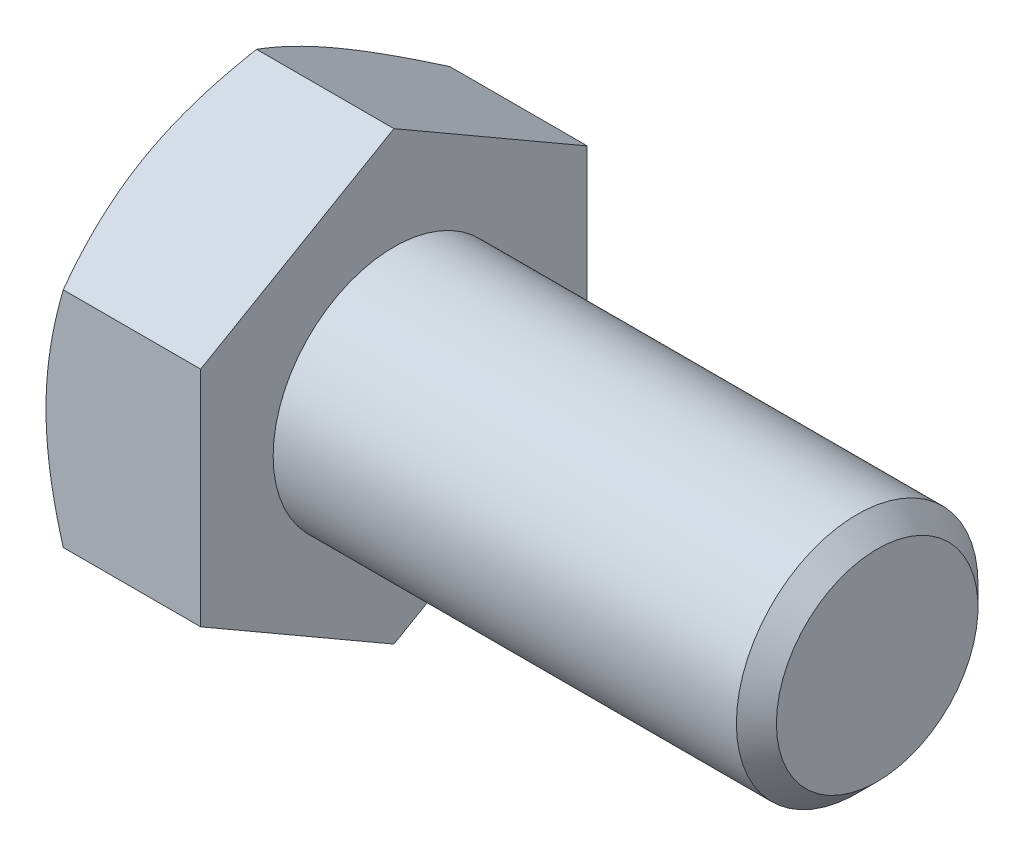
ISO-10303-21;
HEADER;
FILE_DESCRIPTION(('STEP AP214'),'2;1');
FILE_NAME('part.step','',(''),(''),'','','');
FILE_SCHEMA(('AUTOMOTIVE_DESIGN { 1 0 10303 214 1 1 1 1 }'));
ENDSEC;
DATA;
#1=APPLICATION_CONTEXT('core data for automotive mechanical design processes');
#2=APPLICATION_PROTOCOL_DEFINITION('international standard','automotive_design',2000,#1);
#3=PRODUCT_CONTEXT('',#1,'mechanical');
#4=PRODUCT('Part','Part','',(#3));
#5=PRODUCT_RELATED_PRODUCT_CATEGORY('part','',(#4));
#6=PRODUCT_DEFINITION_FORMATION('','',#4);
#7=PRODUCT_DEFINITION_CONTEXT('part definition',#1,'design');
#8=PRODUCT_DEFINITION('design','',#6,#7);
#9=PRODUCT_DEFINITION_SHAPE('','',#8);
#10=(LENGTH_UNIT() NAMED_UNIT(*) SI_UNIT(.MILLI.,.METRE.));
#11=(NAMED_UNIT(*) PLANE_ANGLE_UNIT() SI_UNIT($,.RADIAN.));
#12=(NAMED_UNIT(*) SI_UNIT($,.STERADIAN.) SOLID_ANGLE_UNIT());
#13=UNCERTAINTY_MEASURE_WITH_UNIT(LENGTH_MEASURE(1.E-05),#10,'distance_accuracy_value','');
#14=(GEOMETRIC_REPRESENTATION_CONTEXT(3) GLOBAL_UNCERTAINTY_ASSIGNED_CONTEXT((#13)) GLOBAL_UNIT_ASSIGNED_CONTEXT((#10,
#11,#12)) REPRESENTATION_CONTEXT('',''));
#15=CARTESIAN_POINT('',(0.,0.,0.));
#16=DIRECTION('',(0.,0.,1.));
#17=DIRECTION('',(1.,0.,0.));
#18=AXIS2_PLACEMENT_3D('',#15,#16,#17);
#19=CARTESIAN_POINT('',(6.4,4.618802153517,-8.));
#20=DIRECTION('',(0.,-0.866025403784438,0.500000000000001));
#21=DIRECTION('',(0.,-0.500000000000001,-0.866025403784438));
#22=AXIS2_PLACEMENT_3D('',#19,#20,#21);
#23=PLANE('',#22);
#24=CARTESIAN_POINT('',(0.714597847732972,9.23771977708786,0.0002));
#25=CARTESIAN_POINT('',(0.655990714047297,9.13619343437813,-0.175648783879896));
#26=CARTESIAN_POINT('',(0.60004340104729,9.03428856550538,-0.352153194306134));
#27=CARTESIAN_POINT('',(0.494201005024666,8.82965122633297,-0.706595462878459));
#28=CARTESIAN_POINT('',(0.444308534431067,8.72691841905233,-0.884533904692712));
#29=CARTESIAN_POINT('',(0.304692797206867,8.41707512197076,-1.42119823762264));
#30=CARTESIAN_POINT('',(0.225281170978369,8.20874154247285,-1.78204258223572));
#31=CARTESIAN_POINT('',(0.132161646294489,7.89697436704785,-2.32203917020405));
#32=CARTESIAN_POINT('',(0.105634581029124,7.79447216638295,-2.49957818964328));
#33=CARTESIAN_POINT('',(0.0611531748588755,7.58900421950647,-2.8554591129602));
#34=CARTESIAN_POINT('',(0.0431980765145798,7.4860385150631,-3.03380094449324));
#35=CARTESIAN_POINT('',(0.0163156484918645,7.27992981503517,-3.39079168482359));
#36=CARTESIAN_POINT('',(0.00737807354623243,7.17678715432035,-3.5694400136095));
#37=CARTESIAN_POINT('',(-0.00127769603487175,6.97040655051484,-3.92690170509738));
#38=CARTESIAN_POINT('',(-0.000996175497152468,6.86716861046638,-4.10571506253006));
#39=CARTESIAN_POINT('',(0.00814502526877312,6.67416139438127,-4.4400133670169));
#40=CARTESIAN_POINT('',(0.0158896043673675,6.58437849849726,-4.59552190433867));
#41=CARTESIAN_POINT('',(0.0382011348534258,6.40502298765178,-4.90617476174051));
#42=CARTESIAN_POINT('',(0.0527685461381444,6.31545038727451,-5.06131905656));
#43=CARTESIAN_POINT('',(0.106360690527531,6.04707935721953,-5.52615131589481));
#44=CARTESIAN_POINT('',(0.155268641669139,5.86875596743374,-5.83501648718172));
#45=CARTESIAN_POINT('',(0.277539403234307,5.51021755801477,-6.4560232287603));
#46=CARTESIAN_POINT('',(0.351420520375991,5.3300482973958,-6.76808554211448));
#47=CARTESIAN_POINT('',(0.519100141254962,4.97239658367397,-7.38755648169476));
#48=CARTESIAN_POINT('',(0.612859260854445,4.79490955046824,-7.69497304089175));
#49=CARTESIAN_POINT('',(0.714597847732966,4.61868668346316,-8.0002));
#50=B_SPLINE_CURVE_WITH_KNOTS('',3,(#24,#25,#26,#27,#28,#29,#30,#31,#32,#33,#34,#35,#36,#37,#38,
#39,#40,#41,#42,#43,#44,#45,#46,#47,#48,#49),.UNSPECIFIED.,.F.,.F.,(4,2,2,2,2,2,2,2,2,2,2,2,4),
(0.,0.63397354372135,1.26821965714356,2.53934712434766,3.15934343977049,3.77928496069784,
4.39852133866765,5.01773858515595,5.55680239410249,6.09590254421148,7.17487077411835,
8.27776850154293,9.37850115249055),.UNSPECIFIED.);
#51=CARTESIAN_POINT('',(0.714531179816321,9.23760430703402,0.));
#52=VERTEX_POINT('',#51);
#53=CARTESIAN_POINT('',(0.,6.9282032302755,-4.00000000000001));
#54=VERTEX_POINT('',#53);
#55=EDGE_CURVE('E48',#52,#54,#50,.T.);
#56=ORIENTED_EDGE('',*,*,#55,.F.);
#57=DIRECTION('',(-1.,0.,0.));
#58=VECTOR('',#57,1.);
#59=CARTESIAN_POINT('',(6.4,9.23760430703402,0.));
#60=LINE('',#59,#58);
#61=CARTESIAN_POINT('',(6.4,9.23760430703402,0.));
#62=VERTEX_POINT('',#61);
#63=EDGE_CURVE('E144',#62,#52,#60,.T.);
#64=ORIENTED_EDGE('',*,*,#63,.F.);
#65=DIRECTION('',(0.,0.500000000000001,0.866025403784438));
#66=VECTOR('',#65,1.);
#67=CARTESIAN_POINT('',(6.4,4.618802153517,-8.));
#68=LINE('',#67,#66);
#69=CARTESIAN_POINT('',(6.4,4.618802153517,-8.));
#70=VERTEX_POINT('',#69);
#71=EDGE_CURVE('E235',#70,#62,#68,.T.);
#72=ORIENTED_EDGE('',*,*,#71,.F.);
#73=DIRECTION('',(-1.,0.,0.));
#74=VECTOR('',#73,1.);
#75=CARTESIAN_POINT('',(6.4,4.618802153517,-8.));
#76=LINE('',#75,#74);
#77=CARTESIAN_POINT('',(0.714531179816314,4.618802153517,-8.));
#78=VERTEX_POINT('',#77);
#79=EDGE_CURVE('E132',#70,#78,#76,.T.);
#80=ORIENTED_EDGE('',*,*,#79,.T.);
#81=EDGE_CURVE('E126',#54,#78,#50,.T.);
#82=ORIENTED_EDGE('',*,*,#81,.F.);
#83=EDGE_LOOP('',(#56,#64,#72,#80,#82));
#84=FACE_BOUND('',#83,.T.);
#85=ADVANCED_FACE('F32',(#84),#23,.F.);
#86=CARTESIAN_POINT('',(6.4,9.23760430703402,0.));
#87=DIRECTION('',(0.,-0.866025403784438,-0.500000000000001));
#88=DIRECTION('',(0.,0.500000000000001,-0.866025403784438));
#89=AXIS2_PLACEMENT_3D('',#86,#87,#88);
#90=PLANE('',#89);
#91=CARTESIAN_POINT('',(0.714597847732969,4.61868668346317,8.0002));
#92=CARTESIAN_POINT('',(0.655990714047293,4.72021302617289,7.8243512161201));
#93=CARTESIAN_POINT('',(0.600043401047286,4.82211789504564,7.64784680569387));
#94=CARTESIAN_POINT('',(0.494201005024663,5.02675523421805,7.29340453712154));
#95=CARTESIAN_POINT('',(0.444308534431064,5.12948804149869,7.11546609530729));
#96=CARTESIAN_POINT('',(0.304692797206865,5.43933133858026,6.57880176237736));
#97=CARTESIAN_POINT('',(0.225281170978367,5.64766491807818,6.21795741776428));
#98=CARTESIAN_POINT('',(0.132161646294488,5.95943209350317,5.67796082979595));
#99=CARTESIAN_POINT('',(0.105634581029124,6.06193429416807,5.50042181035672));
#100=CARTESIAN_POINT('',(0.0611531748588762,6.26740224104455,5.1445408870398));
#101=CARTESIAN_POINT('',(0.0431980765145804,6.37036794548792,4.96619905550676));
#102=CARTESIAN_POINT('',(0.0163156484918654,6.57647664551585,4.60920831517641));
#103=CARTESIAN_POINT('',(0.0073780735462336,6.67961930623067,4.4305599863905));
#104=CARTESIAN_POINT('',(-0.0012776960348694,6.88599991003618,4.07309829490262));
#105=CARTESIAN_POINT('',(-0.00099617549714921,6.98923785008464,3.89428493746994));
#106=CARTESIAN_POINT('',(0.0081450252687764,7.18224506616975,3.5599866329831));
#107=CARTESIAN_POINT('',(0.0158896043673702,7.27202796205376,3.40447809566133));
#108=CARTESIAN_POINT('',(0.0382011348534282,7.45138347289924,3.09382523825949));
#109=CARTESIAN_POINT('',(0.0527685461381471,7.54095607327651,2.93868094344));
#110=CARTESIAN_POINT('',(0.106360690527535,7.80932710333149,2.47384868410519));
#111=CARTESIAN_POINT('',(0.155268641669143,7.98765049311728,2.16498351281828));
#112=CARTESIAN_POINT('',(0.277539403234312,8.34618890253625,1.5439767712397));
#113=CARTESIAN_POINT('',(0.351420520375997,8.52635816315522,1.23191445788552));
#114=CARTESIAN_POINT('',(0.519100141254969,8.88400987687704,0.612443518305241));
#115=CARTESIAN_POINT('',(0.612859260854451,9.06149691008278,0.305026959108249));
#116=CARTESIAN_POINT('',(0.714597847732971,9.23771977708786,-0.000200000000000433));
#117=B_SPLINE_CURVE_WITH_KNOTS('',3,(#91,#92,#93,#94,#95,#96,#97,#98,#99,#100,#101,#102,#103,
#104,#105,#106,#107,#108,#109,#110,#111,#112,#113,#114,#115,#116),.UNSPECIFIED.,.F.,.F.,(4,2,2,
2,2,2,2,2,2,2,2,2,4),(0.,0.63397354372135,1.26821965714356,2.53934712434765,3.15934343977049,
3.77928496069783,4.39852133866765,5.01773858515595,5.55680239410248,6.09590254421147,
7.17487077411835,8.27776850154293,9.37850115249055),.UNSPECIFIED.);
#118=CARTESIAN_POINT('',(0.714531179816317,4.61880215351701,8.));
#119=VERTEX_POINT('',#118);
#120=CARTESIAN_POINT('',(0.,6.92820323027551,4.));
#121=VERTEX_POINT('',#120);
#122=EDGE_CURVE('E55',#119,#121,#117,.T.);
#123=ORIENTED_EDGE('',*,*,#122,.F.);
#124=DIRECTION('',(-1.,0.,0.));
#125=VECTOR('',#124,1.);
#126=CARTESIAN_POINT('',(6.4,4.618802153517,8.));
#127=LINE('',#126,#125);
#128=CARTESIAN_POINT('',(6.4,4.618802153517,8.));
#129=VERTEX_POINT('',#128);
#130=EDGE_CURVE('E142',#129,#119,#127,.T.);
#131=ORIENTED_EDGE('',*,*,#130,.F.);
#132=DIRECTION('',(0.,-0.500000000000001,0.866025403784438));
#133=VECTOR('',#132,1.);
#134=CARTESIAN_POINT('',(6.4,9.23760430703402,0.));
#135=LINE('',#134,#133);
#136=EDGE_CURVE('E233',#62,#129,#135,.T.);
#137=ORIENTED_EDGE('',*,*,#136,.F.);
#138=ORIENTED_EDGE('',*,*,#63,.T.);
#139=EDGE_CURVE('E159',#121,#52,#117,.T.);
#140=ORIENTED_EDGE('',*,*,#139,.F.);
#141=EDGE_LOOP('',(#123,#131,#137,#138,#140));
#142=FACE_BOUND('',#141,.T.);
#143=ADVANCED_FACE('F165',(#142),#90,.F.);
#144=CARTESIAN_POINT('',(6.4,4.618802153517,8.));
#145=DIRECTION('',(0.,0.,-1.));
#146=DIRECTION('',(0.,1.,0.));
#147=AXIS2_PLACEMENT_3D('',#144,#145,#146);
#148=PLANE('',#147);
#149=CARTESIAN_POINT('',(4.02490590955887,-12.6546855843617,8.));
#150=CARTESIAN_POINT('',(3.85338487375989,-12.3031246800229,8.));
#151=CARTESIAN_POINT('',(3.68343819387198,-11.9507829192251,8.));
#152=CARTESIAN_POINT('',(3.34757427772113,-11.2441233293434,8.));
#153=CARTESIAN_POINT('',(3.18165763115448,-10.8898052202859,8.));
#154=CARTESIAN_POINT('',(2.85395194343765,-10.1770689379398,8.));
#155=CARTESIAN_POINT('',(2.69218824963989,-9.81863907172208,8.));
#156=CARTESIAN_POINT('',(2.37495726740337,-9.09901412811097,8.));
#157=CARTESIAN_POINT('',(2.21948969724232,-8.7378191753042,8.));
#158=CARTESIAN_POINT('',(1.91124909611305,-7.99950051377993,8.));
#159=CARTESIAN_POINT('',(1.75875676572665,-7.62225899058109,8.));
#160=CARTESIAN_POINT('',(1.46472411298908,-6.8634557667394,8.));
#161=CARTESIAN_POINT('',(1.32318498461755,-6.48189360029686,8.));
#162=CARTESIAN_POINT('',(1.05459432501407,-5.71447512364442,8.));
#163=CARTESIAN_POINT('',(0.927515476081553,-5.32862847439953,8.));
#164=CARTESIAN_POINT('',(0.691757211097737,-4.55141880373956,8.));
#165=CARTESIAN_POINT('',(0.58307225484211,-4.16005748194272,8.));
#166=CARTESIAN_POINT('',(0.389750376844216,-3.37376378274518,8.));
#167=CARTESIAN_POINT('',(0.304973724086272,-2.97886668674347,8.));
#168=CARTESIAN_POINT('',(0.199275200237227,-2.3827345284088,8.));
#169=CARTESIAN_POINT('',(0.167618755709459,-2.18337977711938,8.));
#170=CARTESIAN_POINT('',(0.112075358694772,-1.78359737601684,8.));
#171=CARTESIAN_POINT('',(0.0881876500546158,-1.58316983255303,8.));
#172=CARTESIAN_POINT('',(0.0489706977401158,-1.18423542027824,8.));
#173=CARTESIAN_POINT('',(0.033529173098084,-0.98573963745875,8.));
#174=CARTESIAN_POINT('',(0.011062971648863,-0.588272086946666,8.));
#175=CARTESIAN_POINT('',(0.00403814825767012,-0.389300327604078,8.));
#176=CARTESIAN_POINT('',(-0.0014258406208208,0.00876221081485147,8.));
#177=CARTESIAN_POINT('',(0.000134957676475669,0.20785298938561,8.));
#178=CARTESIAN_POINT('',(0.0118014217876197,0.605786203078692,8.));
#179=CARTESIAN_POINT('',(0.0219074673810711,0.804628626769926,8.));
#180=CARTESIAN_POINT('',(0.0557165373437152,1.27520491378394,8.));
#181=CARTESIAN_POINT('',(0.0830672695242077,1.54668291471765,8.));
#182=CARTESIAN_POINT('',(0.152259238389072,2.08777092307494,8.));
#183=CARTESIAN_POINT('',(0.194102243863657,2.35738069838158,8.));
#184=CARTESIAN_POINT('',(0.339163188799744,3.16301774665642,8.));
#185=CARTESIAN_POINT('',(0.461891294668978,3.69558688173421,8.));
#186=CARTESIAN_POINT('',(0.676586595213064,4.49226053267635,8.));
#187=CARTESIAN_POINT('',(0.754301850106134,4.76044512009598,8.));
#188=CARTESIAN_POINT('',(0.918275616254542,5.29421544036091,8.));
#189=CARTESIAN_POINT('',(1.00453419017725,5.55980115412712,8.));
#190=CARTESIAN_POINT('',(1.1841720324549,6.08844836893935,8.));
#191=CARTESIAN_POINT('',(1.27754931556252,6.35151055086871,8.));
#192=CARTESIAN_POINT('',(1.47027924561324,6.87542420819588,8.));
#193=CARTESIAN_POINT('',(1.56963178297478,7.13627572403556,8.));
#194=CARTESIAN_POINT('',(1.83061788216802,7.80218874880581,8.));
#195=CARTESIAN_POINT('',(1.99585030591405,8.20583800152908,8.));
#196=CARTESIAN_POINT('',(2.33560643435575,9.00922090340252,8.));
#197=CARTESIAN_POINT('',(2.51013099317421,9.40895418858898,8.));
#198=CARTESIAN_POINT('',(2.86641484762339,10.2053302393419,8.));
#199=CARTESIAN_POINT('',(3.04817649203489,10.6019719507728,8.));
#200=CARTESIAN_POINT('',(3.41731474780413,11.3926098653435,8.));
#201=CARTESIAN_POINT('',(3.60469117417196,11.7866061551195,8.));
#202=CARTESIAN_POINT('',(3.98417976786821,12.5730081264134,8.));
#203=CARTESIAN_POINT('',(4.17629837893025,12.9654106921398,8.));
#204=CARTESIAN_POINT('',(4.56413460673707,13.7484335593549,8.));
#205=CARTESIAN_POINT('',(4.75985224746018,14.1390538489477,8.));
#206=CARTESIAN_POINT('',(5.15417790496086,14.91873869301,8.));
#207=CARTESIAN_POINT('',(5.35278537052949,15.3078035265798,8.));
#208=CARTESIAN_POINT('',(5.75241277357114,16.0846929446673,8.));
#209=CARTESIAN_POINT('',(5.9534327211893,16.4725175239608,8.));
#210=CARTESIAN_POINT('',(6.5202315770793,17.5591699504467,8.));
#211=CARTESIAN_POINT('',(6.88826669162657,18.2568207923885,8.));
#212=CARTESIAN_POINT('',(7.62911645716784,19.6496204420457,8.));
#213=CARTESIAN_POINT('',(8.00193135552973,20.3447691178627,8.));
#214=CARTESIAN_POINT('',(8.74998840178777,21.730949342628,8.));
#215=CARTESIAN_POINT('',(9.12521929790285,22.4219869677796,8.));
#216=CARTESIAN_POINT('',(9.69012625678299,23.4573861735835,8.));
#217=CARTESIAN_POINT('',(9.87876537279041,23.8023143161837,8.));
#218=CARTESIAN_POINT('',(10.2566598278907,24.4918321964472,8.));
#219=CARTESIAN_POINT('',(10.4459151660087,24.8364219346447,8.));
#220=CARTESIAN_POINT('',(10.635441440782,25.1808626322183,8.));
#221=B_SPLINE_CURVE_WITH_KNOTS('',3,(#149,#150,#151,#152,#153,#154,#155,#156,#157,#158,#159,
#160,#161,#162,#163,#164,#165,#166,#167,#168,#169,#170,#171,#172,#173,#174,#175,#176,#177,#178,
#179,#180,#181,#182,#183,#184,#185,#186,#187,#188,#189,#190,#191,#192,#193,#194,#195,#196,#197,
#198,#199,#200,#201,#202,#203,#204,#205,#206,#207,#208,#209,#210,#211,#212,#213,#214,#215,#216,
#217,#218,#219,#220),.UNSPECIFIED.,.F.,.F.,(4,2,2,2,2,2,2,2,2,2,2,2,2,2,2,2,2,2,2,2,2,2,2,2,2,2,
2,2,2,2,2,2,2,2,2,4),(0.,1.17352534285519,2.34722138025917,3.52689945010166,4.70652467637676,
5.92708317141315,7.14777452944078,8.36612012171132,9.58409809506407,10.7948027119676,
11.4002329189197,12.0056041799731,12.6027191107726,13.199823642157,13.7969256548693,
14.3940542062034,15.2121538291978,16.030353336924,17.6675489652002,18.5051258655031,
19.3427089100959,20.1800592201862,21.0173941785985,22.3257038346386,23.6341339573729,
24.9429922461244,26.2518074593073,27.5625113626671,28.8732240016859,30.1836898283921,
31.4941611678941,33.8604585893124,36.2268789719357,38.5858914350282,39.7653150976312,
40.9447368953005),.UNSPECIFIED.);
#222=CARTESIAN_POINT('',(0.714531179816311,-4.61880215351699,8.));
#223=VERTEX_POINT('',#222);
#224=CARTESIAN_POINT('',(0.,0.,8.));
#225=VERTEX_POINT('',#224);
#226=EDGE_CURVE('E245',#223,#225,#221,.T.);
#227=ORIENTED_EDGE('',*,*,#226,.F.);
#228=DIRECTION('',(-1.,0.,0.));
#229=VECTOR('',#228,1.);
#230=CARTESIAN_POINT('',(6.4,-4.61880215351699,8.));
#231=LINE('',#230,#229);
#232=CARTESIAN_POINT('',(6.4,-4.61880215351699,8.));
#233=VERTEX_POINT('',#232);
#234=EDGE_CURVE('E134',#233,#223,#231,.T.);
#235=ORIENTED_EDGE('',*,*,#234,.F.);
#236=DIRECTION('',(0.,-1.,0.));
#237=VECTOR('',#236,1.);
#238=CARTESIAN_POINT('',(6.4,4.618802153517,8.));
#239=LINE('',#238,#237);
#240=EDGE_CURVE('E229',#129,#233,#239,.T.);
#241=ORIENTED_EDGE('',*,*,#240,.F.);
#242=ORIENTED_EDGE('',*,*,#130,.T.);
#243=EDGE_CURVE('E183',#225,#119,#221,.T.);
#244=ORIENTED_EDGE('',*,*,#243,.F.);
#245=EDGE_LOOP('',(#227,#235,#241,#242,#244));
#246=FACE_BOUND('',#245,.T.);
#247=ADVANCED_FACE('F251',(#246),#148,.F.);
#248=CARTESIAN_POINT('',(6.4,-9.23760430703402,0.));
#249=DIRECTION('',(0.,0.866025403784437,-0.500000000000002));
#250=DIRECTION('',(0.,0.500000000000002,0.866025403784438));
#251=AXIS2_PLACEMENT_3D('',#248,#249,#250);
#252=PLANE('',#251);
#253=CARTESIAN_POINT('',(0.71459784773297,-9.23771977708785,-0.000200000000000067));
#254=CARTESIAN_POINT('',(0.655990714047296,-9.13619343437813,0.175648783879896));
#255=CARTESIAN_POINT('',(0.600043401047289,-9.03428856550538,0.352153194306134));
#256=CARTESIAN_POINT('',(0.494201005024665,-8.82965122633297,0.706595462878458));
#257=CARTESIAN_POINT('',(0.444308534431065,-8.72691841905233,0.88453390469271));
#258=CARTESIAN_POINT('',(0.304692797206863,-8.41707512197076,1.42119823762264));
#259=CARTESIAN_POINT('',(0.225281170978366,-8.20874154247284,1.78204258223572));
#260=CARTESIAN_POINT('',(0.132161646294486,-7.89697436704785,2.32203917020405));
#261=CARTESIAN_POINT('',(0.105634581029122,-7.79447216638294,2.49957818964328));
#262=CARTESIAN_POINT('',(0.0611531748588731,-7.58900421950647,2.85545911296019));
#263=CARTESIAN_POINT('',(0.043198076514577,-7.4860385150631,3.03380094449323));
#264=CARTESIAN_POINT('',(0.0163156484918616,-7.27992981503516,3.39079168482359));
#265=CARTESIAN_POINT('',(0.00737807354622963,-7.17678715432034,3.5694400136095));
#266=CARTESIAN_POINT('',(-0.00127769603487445,-6.97040655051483,3.92690170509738));
#267=CARTESIAN_POINT('',(-0.00099617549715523,-6.86716861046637,4.10571506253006));
#268=CARTESIAN_POINT('',(0.00814502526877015,-6.67416139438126,4.4400133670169));
#269=CARTESIAN_POINT('',(0.0158896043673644,-6.58437849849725,4.59552190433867));
#270=CARTESIAN_POINT('',(0.0382011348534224,-6.40502298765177,4.9061747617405));
#271=CARTESIAN_POINT('',(0.0527685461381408,-6.31545038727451,5.06131905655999));
#272=CARTESIAN_POINT('',(0.106360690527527,-6.04707935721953,5.52615131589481));
#273=CARTESIAN_POINT('',(0.155268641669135,-5.86875596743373,5.83501648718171));
#274=CARTESIAN_POINT('',(0.277539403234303,-5.51021755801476,6.45602322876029));
#275=CARTESIAN_POINT('',(0.351420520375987,-5.33004829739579,6.76808554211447));
#276=CARTESIAN_POINT('',(0.519100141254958,-4.97239658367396,7.38755648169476));
#277=CARTESIAN_POINT('',(0.612859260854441,-4.79490955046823,7.69497304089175));
#278=CARTESIAN_POINT('',(0.714597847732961,-4.61868668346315,8.0002));
#279=B_SPLINE_CURVE_WITH_KNOTS('',3,(#253,#254,#255,#256,#257,#258,#259,#260,#261,#262,#263,
#264,#265,#266,#267,#268,#269,#270,#271,#272,#273,#274,#275,#276,#277,#278),.UNSPECIFIED.,.F.,
.F.,(4,2,2,2,2,2,2,2,2,2,2,2,4),(0.,0.63397354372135,1.26821965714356,2.53934712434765,
3.15934343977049,3.77928496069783,4.39852133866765,5.01773858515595,5.55680239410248,
6.09590254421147,7.17487077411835,8.27776850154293,9.37850115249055),.UNSPECIFIED.);
#280=CARTESIAN_POINT('',(0.714531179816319,-9.23760430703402,0.));
#281=VERTEX_POINT('',#280);
#282=CARTESIAN_POINT('',(0.,-6.9282032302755,4.00000000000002));
#283=VERTEX_POINT('',#282);
#284=EDGE_CURVE('E167',#281,#283,#279,.T.);
#285=ORIENTED_EDGE('',*,*,#284,.F.);
#286=DIRECTION('',(-1.,0.,0.));
#287=VECTOR('',#286,1.);
#288=CARTESIAN_POINT('',(6.4,-9.23760430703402,0.));
#289=LINE('',#288,#287);
#290=CARTESIAN_POINT('',(6.4,-9.23760430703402,0.));
#291=VERTEX_POINT('',#290);
#292=EDGE_CURVE('E131',#291,#281,#289,.T.);
#293=ORIENTED_EDGE('',*,*,#292,.F.);
#294=DIRECTION('',(0.,-0.500000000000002,-0.866025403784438));
#295=VECTOR('',#294,1.);
#296=CARTESIAN_POINT('',(6.4,-9.23760430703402,0.));
#297=LINE('',#296,#295);
#298=EDGE_CURVE('E227',#233,#291,#297,.T.);
#299=ORIENTED_EDGE('',*,*,#298,.F.);
#300=ORIENTED_EDGE('',*,*,#234,.T.);
#301=EDGE_CURVE('E169',#283,#223,#279,.T.);
#302=ORIENTED_EDGE('',*,*,#301,.F.);
#303=EDGE_LOOP('',(#285,#293,#299,#300,#302));
#304=FACE_BOUND('',#303,.T.);
#305=ADVANCED_FACE('F223',(#304),#252,.F.);
#306=CARTESIAN_POINT('',(6.4,-4.61880215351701,-8.));
#307=DIRECTION('',(0.,0.866025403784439,0.5));
#308=DIRECTION('',(0.,-0.5,0.866025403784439));
#309=AXIS2_PLACEMENT_3D('',#306,#307,#308);
#310=PLANE('',#309);
#311=CARTESIAN_POINT('',(0.714597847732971,-4.61868668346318,-8.0002));
#312=CARTESIAN_POINT('',(0.655990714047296,-4.7202130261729,-7.8243512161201));
#313=CARTESIAN_POINT('',(0.600043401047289,-4.82211789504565,-7.64784680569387));
#314=CARTESIAN_POINT('',(0.494201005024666,-5.02675523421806,-7.29340453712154));
#315=CARTESIAN_POINT('',(0.444308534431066,-5.1294880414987,-7.11546609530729));
#316=CARTESIAN_POINT('',(0.304692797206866,-5.43933133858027,-6.57880176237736));
#317=CARTESIAN_POINT('',(0.22528117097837,-5.64766491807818,-6.21795741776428));
#318=CARTESIAN_POINT('',(0.13216164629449,-5.95943209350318,-5.67796082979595));
#319=CARTESIAN_POINT('',(0.105634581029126,-6.06193429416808,-5.50042181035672));
#320=CARTESIAN_POINT('',(0.0611531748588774,-6.26740224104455,-5.1445408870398));
#321=CARTESIAN_POINT('',(0.0431980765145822,-6.37036794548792,-4.96619905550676));
#322=CARTESIAN_POINT('',(0.0163156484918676,-6.57647664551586,-4.60920831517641));
#323=CARTESIAN_POINT('',(0.00737807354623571,-6.67961930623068,-4.4305599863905));
#324=CARTESIAN_POINT('',(-0.001277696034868,-6.88599991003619,-4.07309829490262));
#325=CARTESIAN_POINT('',(-0.00099617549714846,-6.98923785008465,-3.89428493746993));
#326=CARTESIAN_POINT('',(0.00814502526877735,-7.18224506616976,-3.5599866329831));
#327=CARTESIAN_POINT('',(0.0158896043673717,-7.27202796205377,-3.40447809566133));
#328=CARTESIAN_POINT('',(0.0382011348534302,-7.45138347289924,-3.09382523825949));
#329=CARTESIAN_POINT('',(0.0527685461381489,-7.54095607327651,-2.93868094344));
#330=CARTESIAN_POINT('',(0.106360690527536,-7.80932710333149,-2.47384868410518));
#331=CARTESIAN_POINT('',(0.155268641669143,-7.98765049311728,-2.16498351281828));
#332=CARTESIAN_POINT('',(0.277539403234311,-8.34618890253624,-1.5439767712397));
#333=CARTESIAN_POINT('',(0.351420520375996,-8.52635816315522,-1.23191445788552));
#334=CARTESIAN_POINT('',(0.519100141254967,-8.88400987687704,-0.612443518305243));
#335=CARTESIAN_POINT('',(0.61285926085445,-9.06149691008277,-0.305026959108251));
#336=CARTESIAN_POINT('',(0.714597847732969,-9.23771977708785,0.000199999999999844));
#337=B_SPLINE_CURVE_WITH_KNOTS('',3,(#311,#312,#313,#314,#315,#316,#317,#318,#319,#320,#321,
#322,#323,#324,#325,#326,#327,#328,#329,#330,#331,#332,#333,#334,#335,#336),.UNSPECIFIED.,.F.,
.F.,(4,2,2,2,2,2,2,2,2,2,2,2,4),(0.,0.633973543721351,1.26821965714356,2.53934712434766,
3.15934343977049,3.77928496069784,4.39852133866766,5.01773858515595,5.55680239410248,
6.09590254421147,7.17487077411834,8.27776850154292,9.37850115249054),.UNSPECIFIED.);
#338=CARTESIAN_POINT('',(0.714531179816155,-4.61880215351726,-8.));
#339=VERTEX_POINT('',#338);
#340=CARTESIAN_POINT('',(0.,-6.92820323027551,-4.));
#341=VERTEX_POINT('',#340);
#342=EDGE_CURVE('E108',#339,#341,#337,.T.);
#343=ORIENTED_EDGE('',*,*,#342,.F.);
#344=DIRECTION('',(-1.,0.,0.));
#345=VECTOR('',#344,1.);
#346=CARTESIAN_POINT('',(6.4,-4.61880215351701,-8.));
#347=LINE('',#346,#345);
#348=CARTESIAN_POINT('',(6.4,-4.61880215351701,-8.));
#349=VERTEX_POINT('',#348);
#350=EDGE_CURVE('E122',#349,#339,#347,.T.);
#351=ORIENTED_EDGE('',*,*,#350,.F.);
#352=DIRECTION('',(0.,0.5,-0.866025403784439));
#353=VECTOR('',#352,1.);
#354=CARTESIAN_POINT('',(6.4,-4.61880215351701,-8.));
#355=LINE('',#354,#353);
#356=EDGE_CURVE('E225',#291,#349,#355,.T.);
#357=ORIENTED_EDGE('',*,*,#356,.F.);
#358=ORIENTED_EDGE('',*,*,#292,.T.);
#359=EDGE_CURVE('E125',#341,#281,#337,.T.);
#360=ORIENTED_EDGE('',*,*,#359,.F.);
#361=EDGE_LOOP('',(#343,#351,#357,#358,#360));
#362=FACE_BOUND('',#361,.T.);
#363=ADVANCED_FACE('F120',(#362),#310,.F.);
#364=CARTESIAN_POINT('',(6.4,4.618802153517,-8.));
#365=DIRECTION('',(0.,0.,1.));
#366=DIRECTION('',(1.,0.,0.));
#367=AXIS2_PLACEMENT_3D('',#364,#365,#366);
#368=PLANE('',#367);
#369=CARTESIAN_POINT('',(4.02490590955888,-12.6546855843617,-8.));
#370=CARTESIAN_POINT('',(3.8533848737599,-12.3031246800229,-8.));
#371=CARTESIAN_POINT('',(3.683438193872,-11.9507829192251,-8.));
#372=CARTESIAN_POINT('',(3.34757427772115,-11.2441233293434,-8.));
#373=CARTESIAN_POINT('',(3.18165763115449,-10.889805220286,-8.));
#374=CARTESIAN_POINT('',(2.85395194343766,-10.1770689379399,-8.));
#375=CARTESIAN_POINT('',(2.6921882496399,-9.81863907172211,-8.));
#376=CARTESIAN_POINT('',(2.37495726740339,-9.099014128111,-8.));
#377=CARTESIAN_POINT('',(2.21948969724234,-8.73781917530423,-8.));
#378=CARTESIAN_POINT('',(1.91124909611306,-7.99950051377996,-8.));
#379=CARTESIAN_POINT('',(1.75875676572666,-7.62225899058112,-8.));
#380=CARTESIAN_POINT('',(1.46472411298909,-6.86345576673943,-8.));
#381=CARTESIAN_POINT('',(1.32318498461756,-6.48189360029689,-8.));
#382=CARTESIAN_POINT('',(1.05459432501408,-5.71447512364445,-8.));
#383=CARTESIAN_POINT('',(0.927515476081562,-5.32862847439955,-8.));
#384=CARTESIAN_POINT('',(0.691757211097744,-4.55141880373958,-8.));
#385=CARTESIAN_POINT('',(0.583072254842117,-4.16005748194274,-8.));
#386=CARTESIAN_POINT('',(0.389750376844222,-3.3737637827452,-8.));
#387=CARTESIAN_POINT('',(0.304973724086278,-2.97886668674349,-8.));
#388=CARTESIAN_POINT('',(0.199275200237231,-2.38273452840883,-8.));
#389=CARTESIAN_POINT('',(0.167618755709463,-2.1833797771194,-8.));
#390=CARTESIAN_POINT('',(0.112075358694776,-1.78359737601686,-8.));
#391=CARTESIAN_POINT('',(0.0881876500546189,-1.58316983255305,-8.));
#392=CARTESIAN_POINT('',(0.0489706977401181,-1.18423542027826,-8.));
#393=CARTESIAN_POINT('',(0.0335291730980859,-0.985739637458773,-8.));
#394=CARTESIAN_POINT('',(0.0110629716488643,-0.588272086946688,-8.));
#395=CARTESIAN_POINT('',(0.00403814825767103,-0.3893003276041,-8.));
#396=CARTESIAN_POINT('',(-0.00142584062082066,0.00876221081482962,-8.));
#397=CARTESIAN_POINT('',(0.000134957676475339,0.207852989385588,-8.));
#398=CARTESIAN_POINT('',(0.011801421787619,0.60578620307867,-8.));
#399=CARTESIAN_POINT('',(0.0219074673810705,0.804628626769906,-8.));
#400=CARTESIAN_POINT('',(0.0557165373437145,1.27520491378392,-8.));
#401=CARTESIAN_POINT('',(0.0830672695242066,1.54668291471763,-8.));
#402=CARTESIAN_POINT('',(0.152259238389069,2.08777092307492,-8.));
#403=CARTESIAN_POINT('',(0.194102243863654,2.35738069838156,-8.));
#404=CARTESIAN_POINT('',(0.339163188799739,3.1630177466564,-8.));
#405=CARTESIAN_POINT('',(0.461891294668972,3.69558688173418,-8.));
#406=CARTESIAN_POINT('',(0.676586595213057,4.49226053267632,-8.));
#407=CARTESIAN_POINT('',(0.754301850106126,4.76044512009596,-8.));
#408=CARTESIAN_POINT('',(0.918275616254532,5.29421544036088,-8.));
#409=CARTESIAN_POINT('',(1.00453419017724,5.55980115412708,-8.));
#410=CARTESIAN_POINT('',(1.18417203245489,6.08844836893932,-8.));
#411=CARTESIAN_POINT('',(1.27754931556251,6.35151055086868,-8.));
#412=CARTESIAN_POINT('',(1.47027924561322,6.87542420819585,-8.));
#413=CARTESIAN_POINT('',(1.56963178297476,7.13627572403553,-8.));
#414=CARTESIAN_POINT('',(1.83061788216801,7.80218874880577,-8.));
#415=CARTESIAN_POINT('',(1.99585030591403,8.20583800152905,-8.));
#416=CARTESIAN_POINT('',(2.33560643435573,9.00922090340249,-8.));
#417=CARTESIAN_POINT('',(2.5101309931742,9.40895418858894,-8.));
#418=CARTESIAN_POINT('',(2.86641484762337,10.2053302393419,-8.));
#419=CARTESIAN_POINT('',(3.04817649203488,10.6019719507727,-8.));
#420=CARTESIAN_POINT('',(3.41731474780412,11.3926098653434,-8.));
#421=CARTESIAN_POINT('',(3.60469117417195,11.7866061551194,-8.));
#422=CARTESIAN_POINT('',(3.98417976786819,12.5730081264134,-8.));
#423=CARTESIAN_POINT('',(4.17629837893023,12.9654106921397,-8.));
#424=CARTESIAN_POINT('',(4.56413460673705,13.7484335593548,-8.));
#425=CARTESIAN_POINT('',(4.75985224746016,14.1390538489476,-8.));
#426=CARTESIAN_POINT('',(5.15417790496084,14.91873869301,-8.));
#427=CARTESIAN_POINT('',(5.35278537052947,15.3078035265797,-8.));
#428=CARTESIAN_POINT('',(5.75241277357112,16.0846929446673,-8.));
#429=CARTESIAN_POINT('',(5.95343272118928,16.4725175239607,-8.));
#430=CARTESIAN_POINT('',(6.52023157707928,17.5591699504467,-8.));
#431=CARTESIAN_POINT('',(6.88826669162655,18.2568207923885,-8.));
#432=CARTESIAN_POINT('',(7.62911645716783,19.6496204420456,-8.));
#433=CARTESIAN_POINT('',(8.00193135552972,20.3447691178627,-8.));
#434=CARTESIAN_POINT('',(8.74998840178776,21.730949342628,-8.));
#435=CARTESIAN_POINT('',(9.12521929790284,22.4219869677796,-8.));
#436=CARTESIAN_POINT('',(9.69012625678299,23.4573861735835,-8.));
#437=CARTESIAN_POINT('',(9.87876537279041,23.8023143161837,-8.));
#438=CARTESIAN_POINT('',(10.2566598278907,24.4918321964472,-8.));
#439=CARTESIAN_POINT('',(10.4459151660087,24.8364219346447,-8.));
#440=CARTESIAN_POINT('',(10.635441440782,25.1808626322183,-8.));
#441=B_SPLINE_CURVE_WITH_KNOTS('',3,(#369,#370,#371,#372,#373,#374,#375,#376,#377,#378,#379,
#380,#381,#382,#383,#384,#385,#386,#387,#388,#389,#390,#391,#392,#393,#394,#395,#396,#397,#398,
#399,#400,#401,#402,#403,#404,#405,#406,#407,#408,#409,#410,#411,#412,#413,#414,#415,#416,#417,
#418,#419,#420,#421,#422,#423,#424,#425,#426,#427,#428,#429,#430,#431,#432,#433,#434,#435,#436,
#437,#438,#439,#440),.UNSPECIFIED.,.F.,.F.,(4,2,2,2,2,2,2,2,2,2,2,2,2,2,2,2,2,2,2,2,2,2,2,2,2,2,
2,2,2,2,2,2,2,2,2,4),(0.,1.1735253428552,2.34722138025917,3.52689945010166,4.70652467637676,
5.92708317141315,7.14777452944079,8.36612012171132,9.58409809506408,10.7948027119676,
11.4002329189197,12.0056041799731,12.6027191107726,13.199823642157,13.7969256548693,
14.3940542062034,15.2121538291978,16.0303533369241,17.6675489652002,18.5051258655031,
19.3427089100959,20.1800592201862,21.0173941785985,22.3257038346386,23.6341339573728,
24.9429922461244,26.2518074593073,27.5625113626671,28.8732240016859,30.1836898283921,
31.4941611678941,33.8604585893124,36.2268789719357,38.5858914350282,39.7653150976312,
40.9447368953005),.UNSPECIFIED.);
#442=CARTESIAN_POINT('',(0.,0.,-8.));
#443=VERTEX_POINT('',#442);
#444=EDGE_CURVE('E114',#78,#443,#441,.F.);
#445=ORIENTED_EDGE('',*,*,#444,.F.);
#446=ORIENTED_EDGE('',*,*,#79,.F.);
#447=DIRECTION('',(0.,1.,0.));
#448=VECTOR('',#447,1.);
#449=CARTESIAN_POINT('',(6.4,4.618802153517,-8.));
#450=LINE('',#449,#448);
#451=EDGE_CURVE('E130',#349,#70,#450,.T.);
#452=ORIENTED_EDGE('',*,*,#451,.F.);
#453=ORIENTED_EDGE('',*,*,#350,.T.);
#454=EDGE_CURVE('E105',#443,#339,#441,.F.);
#455=ORIENTED_EDGE('',*,*,#454,.F.);
#456=EDGE_LOOP('',(#445,#446,#452,#453,#455));
#457=FACE_BOUND('',#456,.T.);
#458=ADVANCED_FACE('F128',(#457),#368,.F.);
#459=CARTESIAN_POINT('',(6.4,9.23760430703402,0.));
#460=DIRECTION('',(1.,0.,0.));
#461=DIRECTION('',(0.,0.,-1.));
#462=AXIS2_PLACEMENT_3D('',#459,#460,#461);
#463=PLANE('',#462);
#464=ORIENTED_EDGE('',*,*,#71,.T.);
#465=ORIENTED_EDGE('',*,*,#136,.T.);
#466=ORIENTED_EDGE('',*,*,#240,.T.);
#467=ORIENTED_EDGE('',*,*,#298,.T.);
#468=ORIENTED_EDGE('',*,*,#356,.T.);
#469=ORIENTED_EDGE('',*,*,#451,.T.);
#470=EDGE_LOOP('',(#464,#465,#466,#467,#468,#469));
#471=FACE_BOUND('',#470,.T.);
#472=CARTESIAN_POINT('',(6.4,0.,0.));
#473=DIRECTION('',(1.,0.,0.));
#474=DIRECTION('',(0.,0.,-1.));
#475=AXIS2_PLACEMENT_3D('',#472,#473,#474);
#476=CIRCLE('',#475,5.);
#477=CARTESIAN_POINT('',(6.4,0.,-5.));
#478=VERTEX_POINT('',#477);
#479=EDGE_CURVE('E238',#478,#478,#476,.F.);
#480=ORIENTED_EDGE('',*,*,#479,.T.);
#481=EDGE_LOOP('',(#480));
#482=FACE_BOUND('',#481,.T.);
#483=ADVANCED_FACE('F253',(#471,#482),#463,.T.);
#484=CARTESIAN_POINT('',(0.,0.,0.));
#485=DIRECTION('',(-1.,0.,0.));
#486=DIRECTION('',(0.,0.,1.));
#487=AXIS2_PLACEMENT_3D('',#484,#485,#486);
#488=CYLINDRICAL_SURFACE('',#487,5.);
#489=ORIENTED_EDGE('',*,*,#479,.F.);
#490=EDGE_LOOP('',(#489));
#491=FACE_BOUND('',#490,.T.);
#492=CARTESIAN_POINT('',(25.572,0.,0.));
#493=DIRECTION('',(-1.,0.,0.));
#494=DIRECTION('',(0.,0.,1.));
#495=AXIS2_PLACEMENT_3D('',#492,#493,#494);
#496=CIRCLE('',#495,5.);
#497=CARTESIAN_POINT('',(25.572,0.,5.));
#498=VERTEX_POINT('',#497);
#499=EDGE_CURVE('E241',#498,#498,#496,.T.);
#500=ORIENTED_EDGE('',*,*,#499,.T.);
#501=EDGE_LOOP('',(#500));
#502=FACE_BOUND('',#501,.T.);
#503=ADVANCED_FACE('F285',(#491,#502),#488,.T.);
#504=CARTESIAN_POINT('',(26.4,0.,0.));
#505=DIRECTION('',(-1.,0.,0.));
#506=DIRECTION('',(0.,0.,1.));
#507=AXIS2_PLACEMENT_3D('',#504,#505,#506);
#508=CONICAL_SURFACE('',#507,4.172,0.785398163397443);
#509=ORIENTED_EDGE('',*,*,#499,.F.);
#510=EDGE_LOOP('',(#509));
#511=FACE_BOUND('',#510,.T.);
#512=CARTESIAN_POINT('',(26.4,0.,0.));
#513=DIRECTION('',(-1.,0.,0.));
#514=DIRECTION('',(0.,0.,1.));
#515=AXIS2_PLACEMENT_3D('',#512,#513,#514);
#516=CIRCLE('',#515,4.172);
#517=CARTESIAN_POINT('',(26.4,0.,4.172));
#518=VERTEX_POINT('',#517);
#519=EDGE_CURVE('E243',#518,#518,#516,.T.);
#520=ORIENTED_EDGE('',*,*,#519,.T.);
#521=EDGE_LOOP('',(#520));
#522=FACE_BOUND('',#521,.T.);
#523=ADVANCED_FACE('F287',(#511,#522),#508,.T.);
#524=CARTESIAN_POINT('',(26.4,0.,0.));
#525=DIRECTION('',(-1.,0.,0.));
#526=DIRECTION('',(0.,0.,1.));
#527=AXIS2_PLACEMENT_3D('',#524,#525,#526);
#528=PLANE('',#527);
#529=ORIENTED_EDGE('',*,*,#519,.F.);
#530=EDGE_LOOP('',(#529));
#531=FACE_BOUND('',#530,.T.);
#532=ADVANCED_FACE('F197',(#531),#528,.F.);
#533=CARTESIAN_POINT('',(0.,0.,0.));
#534=DIRECTION('',(1.,0.,0.));
#535=DIRECTION('',(0.,0.,-1.));
#536=AXIS2_PLACEMENT_3D('',#533,#534,#535);
#537=CONICAL_SURFACE('',#536,8.,1.0471975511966);
#538=ORIENTED_EDGE('',*,*,#342,.T.);
#539=CARTESIAN_POINT('',(0.,0.,0.));
#540=DIRECTION('',(1.,0.,0.));
#541=DIRECTION('',(0.,0.,-1.));
#542=AXIS2_PLACEMENT_3D('',#539,#540,#541);
#543=CIRCLE('',#542,8.);
#544=EDGE_CURVE('E36',#341,#443,#543,.T.);
#545=ORIENTED_EDGE('',*,*,#544,.T.);
#546=ORIENTED_EDGE('',*,*,#454,.T.);
#547=EDGE_LOOP('',(#538,#545,#546));
#548=FACE_BOUND('',#547,.T.);
#549=ADVANCED_FACE('F107',(#548),#537,.T.);
#550=ORIENTED_EDGE('',*,*,#284,.T.);
#551=EDGE_CURVE('E149',#283,#341,#543,.T.);
#552=ORIENTED_EDGE('',*,*,#551,.T.);
#553=ORIENTED_EDGE('',*,*,#359,.T.);
#554=EDGE_LOOP('',(#550,#552,#553));
#555=FACE_BOUND('',#554,.T.);
#556=ADVANCED_FACE('F196',(#555),#537,.T.);
#557=ORIENTED_EDGE('',*,*,#226,.T.);
#558=EDGE_CURVE('E150',#225,#283,#543,.T.);
#559=ORIENTED_EDGE('',*,*,#558,.T.);
#560=ORIENTED_EDGE('',*,*,#301,.T.);
#561=EDGE_LOOP('',(#557,#559,#560));
#562=FACE_BOUND('',#561,.T.);
#563=ADVANCED_FACE('F191',(#562),#537,.T.);
#564=ORIENTED_EDGE('',*,*,#243,.T.);
#565=ORIENTED_EDGE('',*,*,#122,.T.);
#566=CARTESIAN_POINT('',(0.,0.,0.));
#567=DIRECTION('',(-1.,0.,0.));
#568=DIRECTION('',(0.,0.,1.));
#569=AXIS2_PLACEMENT_3D('',#566,#567,#568);
#570=CIRCLE('',#569,8.);
#571=EDGE_CURVE('E115',#225,#121,#570,.T.);
#572=ORIENTED_EDGE('',*,*,#571,.F.);
#573=EDGE_LOOP('',(#564,#565,#572));
#574=FACE_BOUND('',#573,.T.);
#575=ADVANCED_FACE('F195',(#574),#537,.T.);
#576=ORIENTED_EDGE('',*,*,#139,.T.);
#577=ORIENTED_EDGE('',*,*,#55,.T.);
#578=EDGE_CURVE('E41',#54,#121,#543,.T.);
#579=ORIENTED_EDGE('',*,*,#578,.T.);
#580=EDGE_LOOP('',(#576,#577,#579));
#581=FACE_BOUND('',#580,.T.);
#582=ADVANCED_FACE('F158',(#581),#537,.T.);
#583=ORIENTED_EDGE('',*,*,#81,.T.);
#584=ORIENTED_EDGE('',*,*,#444,.T.);
#585=EDGE_CURVE('E11',#443,#54,#543,.T.);
#586=ORIENTED_EDGE('',*,*,#585,.T.);
#587=EDGE_LOOP('',(#583,#584,#586));
#588=FACE_BOUND('',#587,.T.);
#589=ADVANCED_FACE('F257',(#588),#537,.T.);
#590=CARTESIAN_POINT('',(0.,9.23760430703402,0.));
#591=DIRECTION('',(1.,0.,0.));
#592=DIRECTION('',(0.,0.,-1.));
#593=AXIS2_PLACEMENT_3D('',#590,#591,#592);
#594=PLANE('',#593);
#595=ORIENTED_EDGE('',*,*,#585,.F.);
#596=ORIENTED_EDGE('',*,*,#544,.F.);
#597=ORIENTED_EDGE('',*,*,#551,.F.);
#598=ORIENTED_EDGE('',*,*,#558,.F.);
#599=ORIENTED_EDGE('',*,*,#571,.T.);
#600=ORIENTED_EDGE('',*,*,#578,.F.);
#601=EDGE_LOOP('',(#595,#596,#597,#598,#599,#600));
#602=FACE_BOUND('',#601,.T.);
#603=ADVANCED_FACE('F162',(#602),#594,.F.);
#604=CLOSED_SHELL('',(#85,#143,#247,#305,#363,#458,#483,#503,#523,#532,#549,#556,#563,#575,#582,
#589,#603));
#605=MANIFOLD_SOLID_BREP('B2',#604);
#606=ADVANCED_BREP_SHAPE_REPRESENTATION('',(#18,#605),#14);
#607=SHAPE_DEFINITION_REPRESENTATION(#9,#606);
ENDSEC;
END-ISO-10303-21;
